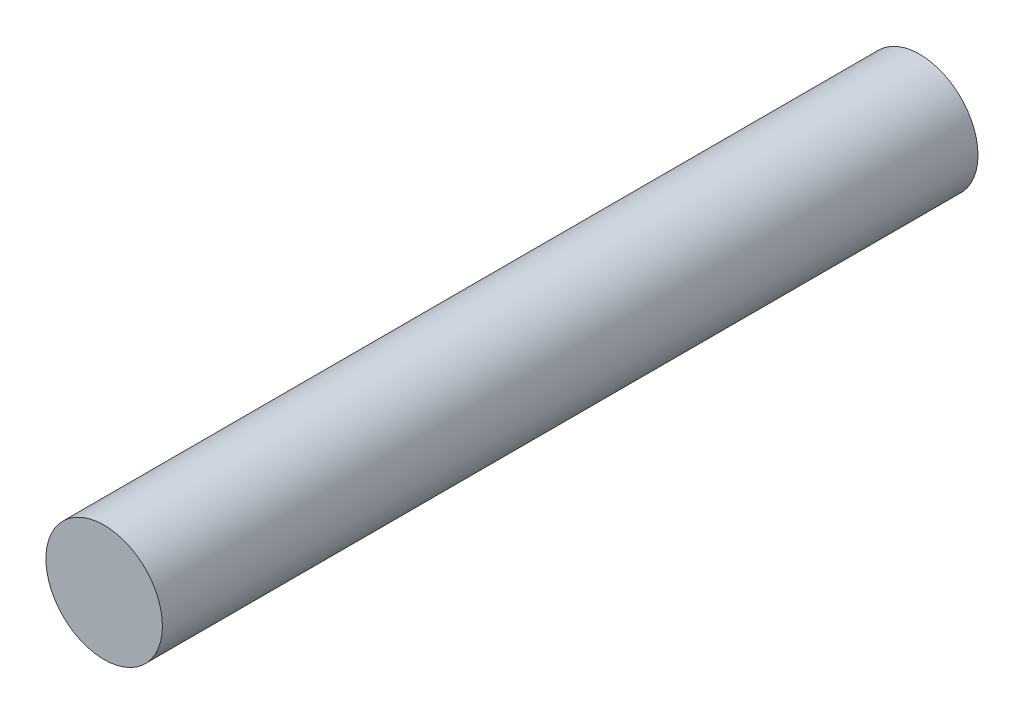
from build123d import *

# Parameters (mm, degrees)
ESQUISSE1_R        = 1
BOSS_EXTRU_1_DEPTH = 14


with BuildPart() as part:
    # Esquisse1 → Boss.-Extru.1 (new body)
    with BuildSketch(Plane.XY):
        Circle(ESQUISSE1_R)
    extrude(amount=BOSS_EXTRU_1_DEPTH)


solid = part.part
